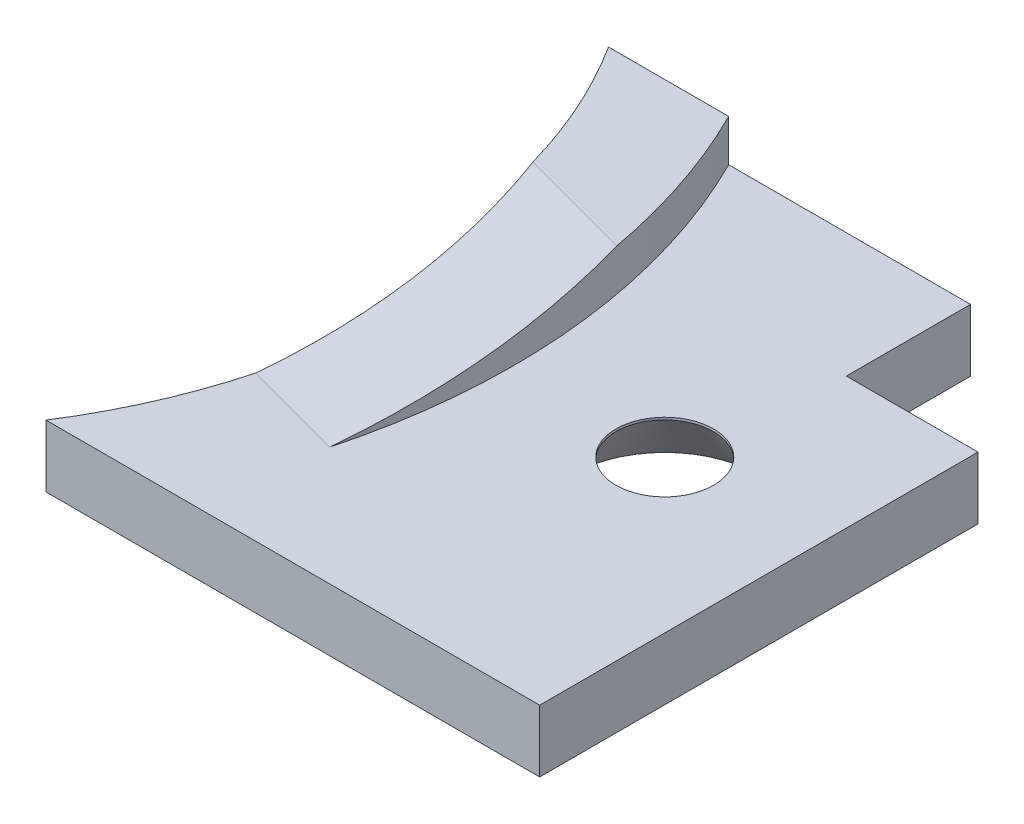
ISO-10303-21;
HEADER;
FILE_DESCRIPTION(('STEP AP214'),'2;1');
FILE_NAME('part.step','',(''),(''),'','','');
FILE_SCHEMA(('AUTOMOTIVE_DESIGN { 1 0 10303 214 1 1 1 1 }'));
ENDSEC;
DATA;
#1=APPLICATION_CONTEXT('core data for automotive mechanical design processes');
#2=APPLICATION_PROTOCOL_DEFINITION('international standard','automotive_design',2000,#1);
#3=PRODUCT_CONTEXT('',#1,'mechanical');
#4=PRODUCT('Part','Part','',(#3));
#5=PRODUCT_RELATED_PRODUCT_CATEGORY('part','',(#4));
#6=PRODUCT_DEFINITION_FORMATION('','',#4);
#7=PRODUCT_DEFINITION_CONTEXT('part definition',#1,'design');
#8=PRODUCT_DEFINITION('design','',#6,#7);
#9=PRODUCT_DEFINITION_SHAPE('','',#8);
#10=(LENGTH_UNIT() NAMED_UNIT(*) SI_UNIT(.MILLI.,.METRE.));
#11=(NAMED_UNIT(*) PLANE_ANGLE_UNIT() SI_UNIT($,.RADIAN.));
#12=(NAMED_UNIT(*) SI_UNIT($,.STERADIAN.) SOLID_ANGLE_UNIT());
#13=UNCERTAINTY_MEASURE_WITH_UNIT(LENGTH_MEASURE(1.E-05),#10,'distance_accuracy_value','');
#14=(GEOMETRIC_REPRESENTATION_CONTEXT(3) GLOBAL_UNCERTAINTY_ASSIGNED_CONTEXT((#13)) GLOBAL_UNIT_ASSIGNED_CONTEXT((#10,
#11,#12)) REPRESENTATION_CONTEXT('',''));
#15=CARTESIAN_POINT('',(0.,0.,0.));
#16=DIRECTION('',(0.,0.,1.));
#17=DIRECTION('',(1.,0.,0.));
#18=AXIS2_PLACEMENT_3D('',#15,#16,#17);
#19=CARTESIAN_POINT('',(-31.2610975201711,2.08,-9.4));
#20=DIRECTION('',(0.,-1.,0.));
#21=DIRECTION('',(0.,0.,-1.));
#22=AXIS2_PLACEMENT_3D('',#19,#20,#21);
#23=CYLINDRICAL_SURFACE('',#22,17.5);
#24=CARTESIAN_POINT('',(-31.2610975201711,2.08,-9.4));
#25=DIRECTION('',(0.,1.,0.));
#26=DIRECTION('',(0.,0.,1.));
#27=AXIS2_PLACEMENT_3D('',#24,#25,#26);
#28=CIRCLE('',#27,17.5);
#29=CARTESIAN_POINT('',(-16.5,2.08,0.));
#30=VERTEX_POINT('',#29);
#31=CARTESIAN_POINT('',(-14.3573955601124,2.08,-4.87066671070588));
#32=VERTEX_POINT('',#31);
#33=EDGE_CURVE('E187',#30,#32,#28,.T.);
#34=ORIENTED_EDGE('',*,*,#33,.T.);
#35=CARTESIAN_POINT('',(-31.2610975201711,2.07999999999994,-9.4));
#36=DIRECTION('',(-0.0397823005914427,0.988116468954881,0.148469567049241));
#37=DIRECTION('',(-0.255743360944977,-0.153707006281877,0.95444721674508));
#38=AXIS2_PLACEMENT_3D('',#35,#36,#37);
#39=ELLIPSE('',#38,17.7104628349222,17.5);
#40=CARTESIAN_POINT('',(-14.4347915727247,3.48,-14.2088905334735));
#41=VERTEX_POINT('',#40);
#42=EDGE_CURVE('E109',#32,#41,#39,.T.);
#43=ORIENTED_EDGE('',*,*,#42,.T.);
#44=CARTESIAN_POINT('',(-31.2610975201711,3.48,-9.4));
#45=DIRECTION('',(0.,1.,0.));
#46=DIRECTION('',(0.,0.,1.));
#47=AXIS2_PLACEMENT_3D('',#44,#45,#46);
#48=CIRCLE('',#47,17.5);
#49=CARTESIAN_POINT('',(-16.5,3.48,-18.8));
#50=VERTEX_POINT('',#49);
#51=EDGE_CURVE('E167',#50,#41,#48,.F.);
#52=ORIENTED_EDGE('',*,*,#51,.F.);
#53=DIRECTION('',(0.,-1.,0.));
#54=VECTOR('',#53,1.);
#55=CARTESIAN_POINT('',(-16.5,2.08,-18.8));
#56=LINE('',#55,#54);
#57=CARTESIAN_POINT('',(-16.5,0.,-18.8));
#58=VERTEX_POINT('',#57);
#59=EDGE_CURVE('E180',#50,#58,#56,.T.);
#60=ORIENTED_EDGE('',*,*,#59,.T.);
#61=CARTESIAN_POINT('',(-31.2610975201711,0.,-9.4));
#62=DIRECTION('',(0.,1.,0.));
#63=DIRECTION('',(0.,0.,1.));
#64=AXIS2_PLACEMENT_3D('',#61,#62,#63);
#65=CIRCLE('',#64,17.5);
#66=CARTESIAN_POINT('',(-16.5,0.,0.));
#67=VERTEX_POINT('',#66);
#68=EDGE_CURVE('E176',#67,#58,#65,.T.);
#69=ORIENTED_EDGE('',*,*,#68,.F.);
#70=DIRECTION('',(0.,-1.,0.));
#71=VECTOR('',#70,1.);
#72=CARTESIAN_POINT('',(-16.5,2.08,0.));
#73=LINE('',#72,#71);
#74=EDGE_CURVE('E231',#30,#67,#73,.T.);
#75=ORIENTED_EDGE('',*,*,#74,.F.);
#76=EDGE_LOOP('',(#34,#43,#52,#60,#69,#75));
#77=FACE_BOUND('',#76,.T.);
#78=ADVANCED_FACE('F85',(#77),#23,.F.);
#79=CARTESIAN_POINT('',(0.,2.08,0.));
#80=DIRECTION('',(0.,0.,-1.));
#81=DIRECTION('',(-1.,0.,0.));
#82=AXIS2_PLACEMENT_3D('',#79,#80,#81);
#83=PLANE('',#82);
#84=DIRECTION('',(1.,0.,0.));
#85=VECTOR('',#84,1.);
#86=CARTESIAN_POINT('',(0.,0.,0.));
#87=LINE('',#86,#85);
#88=CARTESIAN_POINT('',(0.,0.,0.));
#89=VERTEX_POINT('',#88);
#90=EDGE_CURVE('E208',#67,#89,#87,.T.);
#91=ORIENTED_EDGE('',*,*,#90,.T.);
#92=DIRECTION('',(0.,-1.,0.));
#93=VECTOR('',#92,1.);
#94=CARTESIAN_POINT('',(0.,2.08,0.));
#95=LINE('',#94,#93);
#96=CARTESIAN_POINT('',(0.,2.08,0.));
#97=VERTEX_POINT('',#96);
#98=EDGE_CURVE('E229',#97,#89,#95,.T.);
#99=ORIENTED_EDGE('',*,*,#98,.F.);
#100=DIRECTION('',(1.,0.,0.));
#101=VECTOR('',#100,1.);
#102=CARTESIAN_POINT('',(0.,2.08,0.));
#103=LINE('',#102,#101);
#104=EDGE_CURVE('E189',#30,#97,#103,.T.);
#105=ORIENTED_EDGE('',*,*,#104,.F.);
#106=ORIENTED_EDGE('',*,*,#74,.T.);
#107=EDGE_LOOP('',(#91,#99,#105,#106));
#108=FACE_BOUND('',#107,.T.);
#109=ADVANCED_FACE('F249',(#108),#83,.F.);
#110=CARTESIAN_POINT('',(0.,2.08,0.));
#111=DIRECTION('',(1.,0.,0.));
#112=DIRECTION('',(0.,0.,-1.));
#113=AXIS2_PLACEMENT_3D('',#110,#111,#112);
#114=PLANE('',#113);
#115=DIRECTION('',(0.,0.,1.));
#116=VECTOR('',#115,1.);
#117=CARTESIAN_POINT('',(0.,0.,0.));
#118=LINE('',#117,#116);
#119=CARTESIAN_POINT('',(0.,0.,-14.65));
#120=VERTEX_POINT('',#119);
#121=EDGE_CURVE('E211',#120,#89,#118,.T.);
#122=ORIENTED_EDGE('',*,*,#121,.F.);
#123=DIRECTION('',(0.,-1.,0.));
#124=VECTOR('',#123,1.);
#125=CARTESIAN_POINT('',(0.,2.08,-14.65));
#126=LINE('',#125,#124);
#127=CARTESIAN_POINT('',(0.,2.08,-14.65));
#128=VERTEX_POINT('',#127);
#129=EDGE_CURVE('E227',#128,#120,#126,.T.);
#130=ORIENTED_EDGE('',*,*,#129,.F.);
#131=DIRECTION('',(0.,0.,1.));
#132=VECTOR('',#131,1.);
#133=CARTESIAN_POINT('',(0.,2.08,0.));
#134=LINE('',#133,#132);
#135=EDGE_CURVE('E192',#128,#97,#134,.T.);
#136=ORIENTED_EDGE('',*,*,#135,.T.);
#137=ORIENTED_EDGE('',*,*,#98,.T.);
#138=EDGE_LOOP('',(#122,#130,#136,#137));
#139=FACE_BOUND('',#138,.T.);
#140=ADVANCED_FACE('F254',(#139),#114,.T.);
#141=CARTESIAN_POINT('',(0.,2.08,-14.65));
#142=DIRECTION('',(0.,0.,-1.));
#143=DIRECTION('',(-1.,0.,0.));
#144=AXIS2_PLACEMENT_3D('',#141,#142,#143);
#145=PLANE('',#144);
#146=DIRECTION('',(1.,0.,0.));
#147=VECTOR('',#146,1.);
#148=CARTESIAN_POINT('',(0.,0.,-14.65));
#149=LINE('',#148,#147);
#150=CARTESIAN_POINT('',(-4.4,0.,-14.65));
#151=VERTEX_POINT('',#150);
#152=EDGE_CURVE('E214',#151,#120,#149,.T.);
#153=ORIENTED_EDGE('',*,*,#152,.F.);
#154=DIRECTION('',(0.,-1.,0.));
#155=VECTOR('',#154,1.);
#156=CARTESIAN_POINT('',(-4.4,2.08,-14.65));
#157=LINE('',#156,#155);
#158=CARTESIAN_POINT('',(-4.4,2.08,-14.65));
#159=VERTEX_POINT('',#158);
#160=EDGE_CURVE('E225',#159,#151,#157,.T.);
#161=ORIENTED_EDGE('',*,*,#160,.F.);
#162=DIRECTION('',(1.,0.,0.));
#163=VECTOR('',#162,1.);
#164=CARTESIAN_POINT('',(0.,2.08,-14.65));
#165=LINE('',#164,#163);
#166=EDGE_CURVE('E195',#159,#128,#165,.T.);
#167=ORIENTED_EDGE('',*,*,#166,.T.);
#168=ORIENTED_EDGE('',*,*,#129,.T.);
#169=EDGE_LOOP('',(#153,#161,#167,#168));
#170=FACE_BOUND('',#169,.T.);
#171=ADVANCED_FACE('F265',(#170),#145,.T.);
#172=CARTESIAN_POINT('',(-4.39999999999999,2.08,0.));
#173=DIRECTION('',(1.,0.,0.));
#174=DIRECTION('',(0.,0.,-1.));
#175=AXIS2_PLACEMENT_3D('',#172,#173,#174);
#176=PLANE('',#175);
#177=DIRECTION('',(0.,0.,1.));
#178=VECTOR('',#177,1.);
#179=CARTESIAN_POINT('',(-4.39999999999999,0.,0.));
#180=LINE('',#179,#178);
#181=CARTESIAN_POINT('',(-4.4,0.,-18.8));
#182=VERTEX_POINT('',#181);
#183=EDGE_CURVE('E217',#182,#151,#180,.T.);
#184=ORIENTED_EDGE('',*,*,#183,.F.);
#185=DIRECTION('',(0.,-1.,0.));
#186=VECTOR('',#185,1.);
#187=CARTESIAN_POINT('',(-4.4,2.08,-18.8));
#188=LINE('',#187,#186);
#189=CARTESIAN_POINT('',(-4.4,2.08,-18.8));
#190=VERTEX_POINT('',#189);
#191=EDGE_CURVE('E223',#190,#182,#188,.T.);
#192=ORIENTED_EDGE('',*,*,#191,.F.);
#193=DIRECTION('',(0.,0.,1.));
#194=VECTOR('',#193,1.);
#195=CARTESIAN_POINT('',(-4.39999999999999,2.08,0.));
#196=LINE('',#195,#194);
#197=EDGE_CURVE('E198',#190,#159,#196,.T.);
#198=ORIENTED_EDGE('',*,*,#197,.T.);
#199=ORIENTED_EDGE('',*,*,#160,.T.);
#200=EDGE_LOOP('',(#184,#192,#198,#199));
#201=FACE_BOUND('',#200,.T.);
#202=ADVANCED_FACE('F269',(#201),#176,.T.);
#203=CARTESIAN_POINT('',(0.,2.08,-18.8));
#204=DIRECTION('',(0.,0.,-1.));
#205=DIRECTION('',(-1.,0.,0.));
#206=AXIS2_PLACEMENT_3D('',#203,#204,#205);
#207=PLANE('',#206);
#208=DIRECTION('',(1.,0.,0.));
#209=VECTOR('',#208,1.);
#210=CARTESIAN_POINT('',(0.,0.,-18.8));
#211=LINE('',#210,#209);
#212=EDGE_CURVE('E190',#58,#182,#211,.T.);
#213=ORIENTED_EDGE('',*,*,#212,.F.);
#214=ORIENTED_EDGE('',*,*,#59,.F.);
#215=DIRECTION('',(-1.,0.,0.));
#216=VECTOR('',#215,1.);
#217=CARTESIAN_POINT('',(0.,3.48,-18.8));
#218=LINE('',#217,#216);
#219=CARTESIAN_POINT('',(-12.4823861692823,3.48,-18.8));
#220=VERTEX_POINT('',#219);
#221=EDGE_CURVE('E164',#220,#50,#218,.T.);
#222=ORIENTED_EDGE('',*,*,#221,.F.);
#223=DIRECTION('',(0.,-1.,0.));
#224=VECTOR('',#223,1.);
#225=CARTESIAN_POINT('',(-12.4823861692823,3.48,-18.8));
#226=LINE('',#225,#224);
#227=CARTESIAN_POINT('',(-12.4823861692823,2.08,-18.8));
#228=VERTEX_POINT('',#227);
#229=EDGE_CURVE('E171',#220,#228,#226,.T.);
#230=ORIENTED_EDGE('',*,*,#229,.T.);
#231=DIRECTION('',(1.,0.,0.));
#232=VECTOR('',#231,1.);
#233=CARTESIAN_POINT('',(0.,2.08,-18.8));
#234=LINE('',#233,#232);
#235=EDGE_CURVE('E201',#228,#190,#234,.T.);
#236=ORIENTED_EDGE('',*,*,#235,.T.);
#237=ORIENTED_EDGE('',*,*,#191,.T.);
#238=EDGE_LOOP('',(#213,#214,#222,#230,#236,#237));
#239=FACE_BOUND('',#238,.T.);
#240=ADVANCED_FACE('F179',(#239),#207,.T.);
#241=CARTESIAN_POINT('',(-5.09,2.08,-9.27100149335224));
#242=DIRECTION('',(0.,-1.,0.));
#243=DIRECTION('',(0.,0.,-1.));
#244=AXIS2_PLACEMENT_3D('',#241,#242,#243);
#245=CYLINDRICAL_SURFACE('',#244,1.63199987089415);
#246=CARTESIAN_POINT('',(-5.09,2.00000000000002,-9.27100149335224));
#247=DIRECTION('',(0.,1.,0.));
#248=DIRECTION('',(0.,0.,1.));
#249=AXIS2_PLACEMENT_3D('',#246,#247,#248);
#250=CIRCLE('',#249,1.63199987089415);
#251=CARTESIAN_POINT('',(-5.09,2.00000000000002,-7.63900162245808));
#252=VERTEX_POINT('',#251);
#253=EDGE_CURVE('E12',#252,#252,#250,.F.);
#254=ORIENTED_EDGE('',*,*,#253,.T.);
#255=EDGE_LOOP('',(#254));
#256=FACE_BOUND('',#255,.T.);
#257=CARTESIAN_POINT('',(-5.09,2.08,-9.27100149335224));
#258=DIRECTION('',(0.,1.,0.));
#259=DIRECTION('',(0.,0.,1.));
#260=AXIS2_PLACEMENT_3D('',#257,#258,#259);
#261=CIRCLE('',#260,1.63199987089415);
#262=CARTESIAN_POINT('',(-5.09,2.08,-7.63900162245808));
#263=VERTEX_POINT('',#262);
#264=EDGE_CURVE('E203',#263,#263,#261,.T.);
#265=ORIENTED_EDGE('',*,*,#264,.T.);
#266=EDGE_LOOP('',(#265));
#267=FACE_BOUND('',#266,.T.);
#268=ADVANCED_FACE('F276',(#256,#267),#245,.F.);
#269=CARTESIAN_POINT('',(0.,2.08,0.));
#270=DIRECTION('',(0.,1.,0.));
#271=DIRECTION('',(0.,0.,1.));
#272=AXIS2_PLACEMENT_3D('',#269,#270,#271);
#273=PLANE('',#272);
#274=CARTESIAN_POINT('',(-31.2610975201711,2.08,-9.4));
#275=DIRECTION('',(0.,1.,0.));
#276=DIRECTION('',(0.,0.,1.));
#277=AXIS2_PLACEMENT_3D('',#274,#275,#276);
#278=CIRCLE('',#277,21.);
#279=CARTESIAN_POINT('',(-10.9766551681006,2.08,-3.96480005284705));
#280=VERTEX_POINT('',#279);
#281=EDGE_CURVE('E174',#280,#228,#278,.T.);
#282=ORIENTED_EDGE('',*,*,#281,.F.);
#283=DIRECTION('',(0.965925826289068,0.,0.258819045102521));
#284=VECTOR('',#283,1.);
#285=CARTESIAN_POINT('',(0.255903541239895,2.08,-0.955045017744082));
#286=LINE('',#285,#284);
#287=EDGE_CURVE('E184',#32,#280,#286,.T.);
#288=ORIENTED_EDGE('',*,*,#287,.F.);
#289=ORIENTED_EDGE('',*,*,#33,.F.);
#290=ORIENTED_EDGE('',*,*,#104,.T.);
#291=ORIENTED_EDGE('',*,*,#135,.F.);
#292=ORIENTED_EDGE('',*,*,#166,.F.);
#293=ORIENTED_EDGE('',*,*,#197,.F.);
#294=ORIENTED_EDGE('',*,*,#235,.F.);
#295=EDGE_LOOP('',(#282,#288,#289,#290,#291,#292,#293,#294));
#296=FACE_BOUND('',#295,.T.);
#297=ORIENTED_EDGE('',*,*,#264,.F.);
#298=EDGE_LOOP('',(#297));
#299=FACE_BOUND('',#298,.T.);
#300=ADVANCED_FACE('F279',(#296,#299),#273,.T.);
#301=CARTESIAN_POINT('',(0.,0.,0.));
#302=DIRECTION('',(0.,1.,0.));
#303=DIRECTION('',(0.,0.,1.));
#304=AXIS2_PLACEMENT_3D('',#301,#302,#303);
#305=PLANE('',#304);
#306=CARTESIAN_POINT('',(-5.09,0.,-9.27100149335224));
#307=DIRECTION('',(0.,1.,0.));
#308=DIRECTION('',(0.,0.,1.));
#309=AXIS2_PLACEMENT_3D('',#306,#307,#308);
#310=CIRCLE('',#309,3.13199987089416);
#311=CARTESIAN_POINT('',(-5.09,0.,-6.13900162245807));
#312=VERTEX_POINT('',#311);
#313=EDGE_CURVE('E94',#312,#312,#310,.T.);
#314=ORIENTED_EDGE('',*,*,#313,.T.);
#315=EDGE_LOOP('',(#314));
#316=FACE_BOUND('',#315,.T.);
#317=ORIENTED_EDGE('',*,*,#68,.T.);
#318=ORIENTED_EDGE('',*,*,#212,.T.);
#319=ORIENTED_EDGE('',*,*,#183,.T.);
#320=ORIENTED_EDGE('',*,*,#152,.T.);
#321=ORIENTED_EDGE('',*,*,#121,.T.);
#322=ORIENTED_EDGE('',*,*,#90,.F.);
#323=EDGE_LOOP('',(#317,#318,#319,#320,#321,#322));
#324=FACE_BOUND('',#323,.T.);
#325=ADVANCED_FACE('F238',(#316,#324),#305,.F.);
#326=CARTESIAN_POINT('',(-31.2610975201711,3.48,-9.4));
#327=DIRECTION('',(0.,-1.,0.));
#328=DIRECTION('',(0.,0.,-1.));
#329=AXIS2_PLACEMENT_3D('',#326,#327,#328);
#330=CYLINDRICAL_SURFACE('',#329,21.);
#331=CARTESIAN_POINT('',(-31.2610975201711,3.48,-9.4));
#332=DIRECTION('',(0.,1.,0.));
#333=DIRECTION('',(0.,0.,1.));
#334=AXIS2_PLACEMENT_3D('',#331,#332,#333);
#335=CIRCLE('',#334,21.);
#336=CARTESIAN_POINT('',(-10.6045721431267,3.48,-13.1825863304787));
#337=VERTEX_POINT('',#336);
#338=EDGE_CURVE('E160',#337,#220,#335,.T.);
#339=ORIENTED_EDGE('',*,*,#338,.F.);
#340=CARTESIAN_POINT('',(-31.2610975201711,2.07999999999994,-9.4));
#341=DIRECTION('',(-0.0397823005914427,0.988116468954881,0.148469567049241));
#342=DIRECTION('',(-0.255743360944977,-0.153707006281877,0.95444721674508));
#343=AXIS2_PLACEMENT_3D('',#340,#341,#342);
#344=ELLIPSE('',#343,21.2525554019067,21.);
#345=EDGE_CURVE('E101',#337,#280,#344,.F.);
#346=ORIENTED_EDGE('',*,*,#345,.T.);
#347=ORIENTED_EDGE('',*,*,#281,.T.);
#348=ORIENTED_EDGE('',*,*,#229,.F.);
#349=EDGE_LOOP('',(#339,#346,#347,#348));
#350=FACE_BOUND('',#349,.T.);
#351=ADVANCED_FACE('F172',(#350),#330,.T.);
#352=CARTESIAN_POINT('',(0.,3.48,0.));
#353=DIRECTION('',(0.,1.,0.));
#354=DIRECTION('',(0.,0.,1.));
#355=AXIS2_PLACEMENT_3D('',#352,#353,#354);
#356=PLANE('',#355);
#357=ORIENTED_EDGE('',*,*,#51,.T.);
#358=DIRECTION('',(0.965925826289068,0.,0.258819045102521));
#359=VECTOR('',#358,1.);
#360=CARTESIAN_POINT('',(-8.64728376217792,3.48,-12.6581324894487));
#361=LINE('',#360,#359);
#362=EDGE_CURVE('E165',#41,#337,#361,.T.);
#363=ORIENTED_EDGE('',*,*,#362,.T.);
#364=ORIENTED_EDGE('',*,*,#338,.T.);
#365=ORIENTED_EDGE('',*,*,#221,.T.);
#366=EDGE_LOOP('',(#357,#363,#364,#365));
#367=FACE_BOUND('',#366,.T.);
#368=ADVANCED_FACE('F162',(#367),#356,.T.);
#369=CARTESIAN_POINT('',(2.58527494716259,3.48,-9.64837745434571));
#370=DIRECTION('',(-0.0397823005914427,0.988116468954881,0.148469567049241));
#371=DIRECTION('',(-0.965925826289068,0.,-0.258819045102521));
#372=AXIS2_PLACEMENT_3D('',#369,#370,#371);
#373=PLANE('',#372);
#374=ORIENTED_EDGE('',*,*,#42,.F.);
#375=ORIENTED_EDGE('',*,*,#287,.T.);
#376=ORIENTED_EDGE('',*,*,#345,.F.);
#377=ORIENTED_EDGE('',*,*,#362,.F.);
#378=EDGE_LOOP('',(#374,#375,#376,#377));
#379=FACE_BOUND('',#378,.T.);
#380=ADVANCED_FACE('F242',(#379),#373,.T.);
#381=CARTESIAN_POINT('',(-5.09,0.,-9.27100149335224));
#382=DIRECTION('',(0.,-1.,0.));
#383=DIRECTION('',(0.,0.,-1.));
#384=AXIS2_PLACEMENT_3D('',#381,#382,#383);
#385=CONICAL_SURFACE('',#384,3.13199987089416,0.643501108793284);
#386=ORIENTED_EDGE('',*,*,#253,.F.);
#387=EDGE_LOOP('',(#386));
#388=FACE_BOUND('',#387,.T.);
#389=ORIENTED_EDGE('',*,*,#313,.F.);
#390=EDGE_LOOP('',(#389));
#391=FACE_BOUND('',#390,.T.);
#392=ADVANCED_FACE('F88',(#388,#391),#385,.F.);
#393=CLOSED_SHELL('',(#78,#109,#140,#171,#202,#240,#268,#300,#325,#351,#368,#380,#392));
#394=MANIFOLD_SOLID_BREP('B2',#393);
#395=ADVANCED_BREP_SHAPE_REPRESENTATION('',(#18,#394),#14);
#396=SHAPE_DEFINITION_REPRESENTATION(#9,#395);
ENDSEC;
END-ISO-10303-21;
